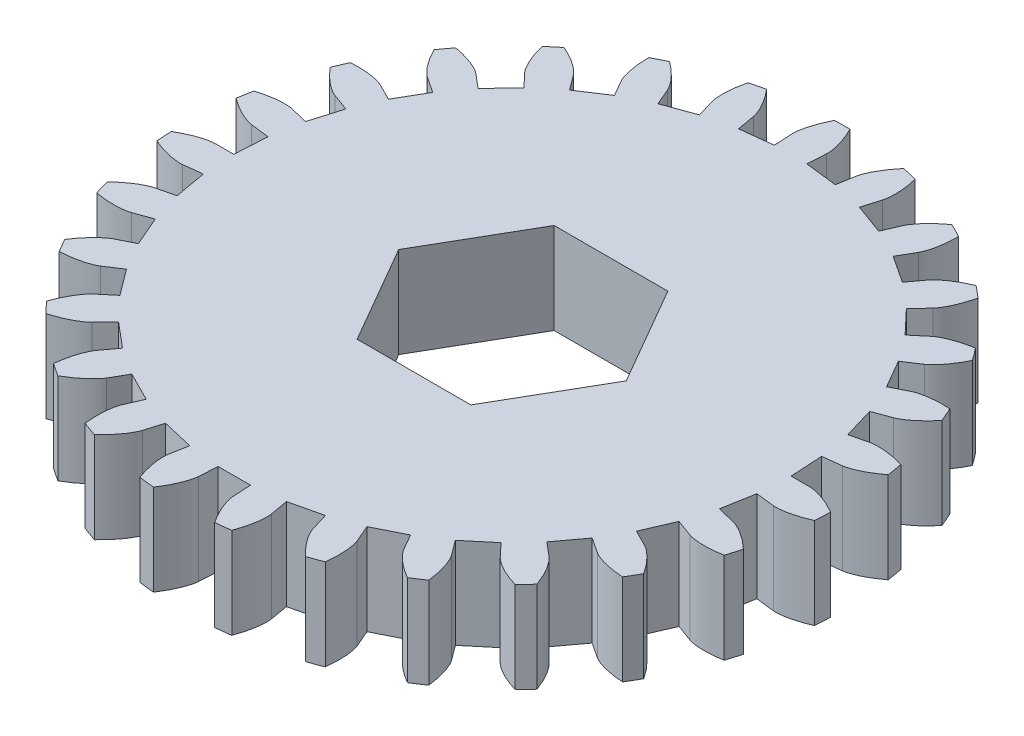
from build123d import *

# Parameters (mm, degrees)
BOSS_EXTRUDE1_DEPTH = 1
CIRPATTERN1_COUNT   = 27
BOSS_EXTRUDE2_START = -1
BOSS_EXTRUDE2_DEPTH = 1
CUT_EXTRUDE1_DEPTH  = 1


with BuildPart() as part:
    # Sketch2 → Boss-Extrude1 (new body)
    with BuildSketch(Plane(origin=(0, 0, 0), x_dir=(1, 0, 0), z_dir=(0, 1, 0))):
        with BuildLine():
            Line((-3.245404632, -0.379333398), (-3.041792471, -0.35553455))
            Line((-3.041792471, -0.35553455), (-2.979949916, -0.706261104))
            Line((-2.979949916, -0.706261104), (-0.486522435, -0.115307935))
            ThreePointArc((-0.486522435, -0.115307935), (-0.496619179, -0.058046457), (-0.5, 0))
            Line((-0.5, 0), (-3.267498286, 0))
            add(Edge.make_bspline(
                [(-3.267498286, 0), (-3.271915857, 0), (-3.284293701, -0.000454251), (-3.307607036, -0.003105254), (-3.345284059, -0.009957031), (-3.392581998, -0.022359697), (-3.452571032, -0.042534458), (-3.518674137, -0.070344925), (-3.569478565, -0.095824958), (-3.606016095, -0.116178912), (-3.622810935, -0.125960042)],
                knots=[0, 0, 0, 0, 0, 0.005376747, 0.015083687, 0.028531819, 0.046610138, 0.064854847, 0.092110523, 0.115778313, 0.115778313, 0.115778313, 0.115778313, 0.115778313], degree=4))
            ThreePointArc((-3.622810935, -0.125960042), (-3.618867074, -0.210775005), (-3.612937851, -0.295474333))
            add(Edge.make_bspline(
                [(-3.245404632, -0.379333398), (-3.249792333, -0.379846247), (-3.262139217, -0.380832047), (-3.285602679, -0.380905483), (-3.323820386, -0.37847407), (-3.372238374, -0.371646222), (-3.434163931, -0.358572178), (-3.503048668, -0.338623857), (-3.556467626, -0.319214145), (-3.595121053, -0.303239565), (-3.612937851, -0.295474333)],
                knots=[0, 0, 0, 0, 0, 0.005376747, 0.015083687, 0.028531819, 0.046610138, 0.064854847, 0.092110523, 0.115778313, 0.115778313, 0.115778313, 0.115778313, 0.115778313], degree=4))
        make_face()
    boss_extrude1 = extrude(amount=BOSS_EXTRUDE1_DEPTH)

    # CirPattern1: Boss-Extrude1 ×27 about axis
    cirpattern1_axis = Axis((0, 0, 0), (0, -1, 0))
    for i in range(1, CIRPATTERN1_COUNT):
        add(boss_extrude1.rotate(cirpattern1_axis, i * 360 / CIRPATTERN1_COUNT))

    # Sketch3 → Boss-Extrude2 (add)
    with BuildSketch(Plane(origin=(0, 1, 0), x_dir=(1, 0, 0), z_dir=(0, 1, 0)).offset(BOSS_EXTRUDE2_START)):
        with BuildLine():
            ThreePointArc((-0.353553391, 0.353553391), (-0.5, 0), (-0.353553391, -0.353553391))
            Line((-0.353553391, -0.353553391), (-0.353553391, 0.353553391))
        make_face()
        with BuildLine():
            ThreePointArc((0.353553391, 0.353553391), (0, 0.5), (-0.353553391, 0.353553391))
            Line((-0.353553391, 0.353553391), (0.353553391, 0.353553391))
        make_face()
        with BuildLine():
            Line((0.353553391, 0.353553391), (0.353553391, -0.353553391))
            ThreePointArc((0.353553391, -0.353553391), (0.461939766, -0.191341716), (0.5, 0))
            ThreePointArc((0.5, 0), (0.461939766, 0.191341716), (0.353553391, 0.353553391))
        make_face()
        with BuildLine():
            Line((0.353553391, -0.353553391), (-0.353553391, -0.353553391))
            ThreePointArc((-0.353553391, -0.353553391), (0, -0.5), (0.353553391, -0.353553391))
        make_face()
    extrude(amount=BOSS_EXTRUDE2_DEPTH)

    # Sketch4 → Cut-Extrude1 (cut)
    with BuildSketch(Plane(origin=(0, 1, 0), x_dir=(1, 0, 0), z_dir=(0, 1, 0))):
        Polygon((1.25, 0), (0.625, 1.082531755), (-0.625, 1.082531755), (-1.25, 0), (-0.625, -1.082531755), (0.625, -1.082531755), align=None)
    extrude(amount=-CUT_EXTRUDE1_DEPTH, mode=Mode.SUBTRACT)


solid = part.part
